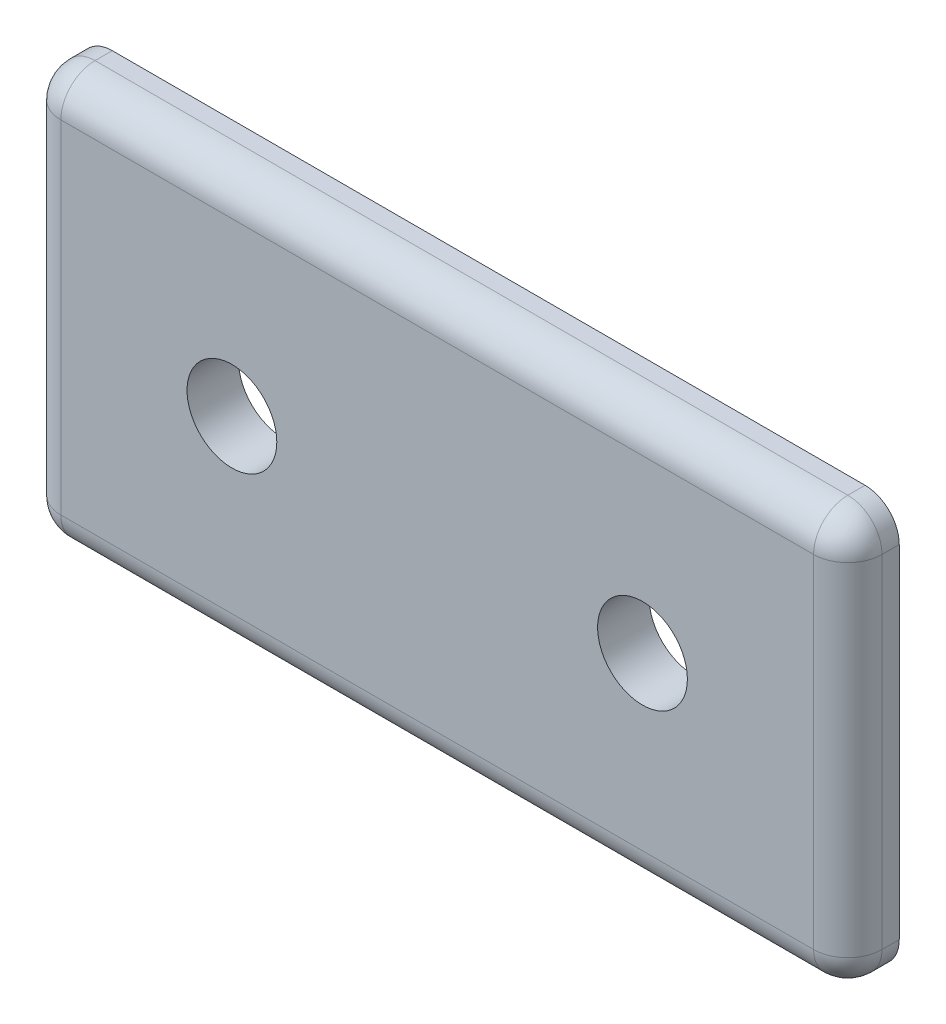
from build123d import *

# Parameters (mm, degrees)
SKETCH1_W           = 76.2
SKETCH1_H           = 38.1
BOSS_EXTRUDE1_DEPTH = 4.7752
FILLET1_R           = 3.175
CUT_EXTRUDE1_REACH  = 44.864
SKETCH2_R           = 4.1656


with BuildPart() as part:
    # Sketch1 → Boss-Extrude1 (new body)
    with BuildSketch(Plane.XY):
        Rectangle(SKETCH1_W, SKETCH1_H)
    extrude(amount=BOSS_EXTRUDE1_DEPTH)

    # Fillet1
    fillet1_edges = [part.edges().sort_by_distance(p)[0] for p in [
        (38.1, 0, 4.7752),
        (0, 19.05, 4.7752),
        (-38.1, 0, 4.7752),
        (0, -19.05, 4.7752),
        (-38.1, 19.05, 2.3876),
        (38.1, 19.05, 2.3876),
        (38.1, -19.05, 2.3876),
        (-38.1, -19.05, 2.3876),
    ]]
    fillet(fillet1_edges, radius=FILLET1_R)

    # Sketch2 → Cut-Extrude1 (cut, up to next)
    with BuildSketch(Plane.XY.offset(4.7752), mode=Mode.PRIVATE) as cut_extrude1_sk1:
        with Locations((-19.05, 0)):
            Circle(SKETCH2_R)
    cut_extrude1_tool1 = extrude(cut_extrude1_sk1.sketch, amount=-CUT_EXTRUDE1_REACH, mode=Mode.PRIVATE) & part.part
    # Sketch2 → Cut-Extrude1 (cut, up to next)
    with BuildSketch(Plane.XY.offset(4.7752), mode=Mode.PRIVATE) as cut_extrude1_sk2:
        with Locations((19.05, 0)):
            Circle(SKETCH2_R)
    cut_extrude1_tool2 = extrude(cut_extrude1_sk2.sketch, amount=-CUT_EXTRUDE1_REACH, mode=Mode.PRIVATE) & part.part
    add(cut_extrude1_tool1.solids().sort_by_distance((-19.05, 0, 4.7752))[0], mode=Mode.SUBTRACT)
    add(cut_extrude1_tool2.solids().sort_by_distance((19.05, 0, 4.7752))[0], mode=Mode.SUBTRACT)


solid = part.part
